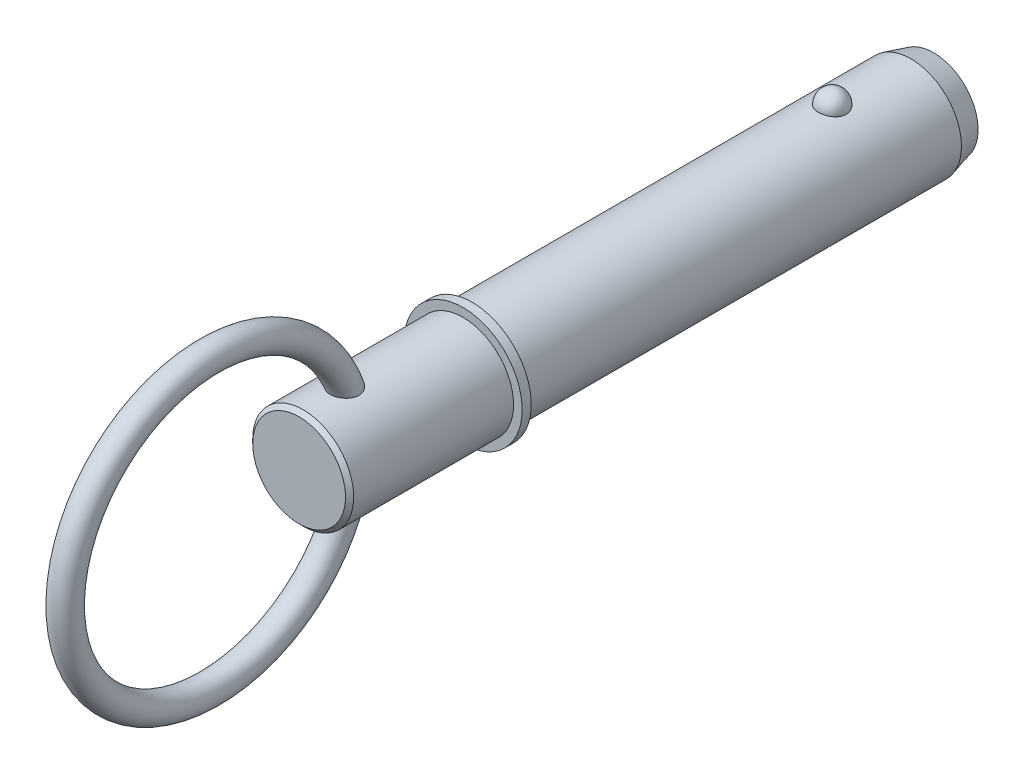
ISO-10303-21;
HEADER;
FILE_DESCRIPTION(('STEP AP214'),'2;1');
FILE_NAME('part.step','',(''),(''),'','','');
FILE_SCHEMA(('AUTOMOTIVE_DESIGN { 1 0 10303 214 1 1 1 1 }'));
ENDSEC;
DATA;
#1=APPLICATION_CONTEXT('core data for automotive mechanical design processes');
#2=APPLICATION_PROTOCOL_DEFINITION('international standard','automotive_design',2000,#1);
#3=PRODUCT_CONTEXT('',#1,'mechanical');
#4=PRODUCT('Part','Part','',(#3));
#5=PRODUCT_RELATED_PRODUCT_CATEGORY('part','',(#4));
#6=PRODUCT_DEFINITION_FORMATION('','',#4);
#7=PRODUCT_DEFINITION_CONTEXT('part definition',#1,'design');
#8=PRODUCT_DEFINITION('design','',#6,#7);
#9=PRODUCT_DEFINITION_SHAPE('','',#8);
#10=(LENGTH_UNIT() NAMED_UNIT(*) SI_UNIT(.MILLI.,.METRE.));
#11=(NAMED_UNIT(*) PLANE_ANGLE_UNIT() SI_UNIT($,.RADIAN.));
#12=(NAMED_UNIT(*) SI_UNIT($,.STERADIAN.) SOLID_ANGLE_UNIT());
#13=UNCERTAINTY_MEASURE_WITH_UNIT(LENGTH_MEASURE(1.E-05),#10,'distance_accuracy_value','');
#14=(GEOMETRIC_REPRESENTATION_CONTEXT(3) GLOBAL_UNCERTAINTY_ASSIGNED_CONTEXT((#13)) GLOBAL_UNIT_ASSIGNED_CONTEXT((#10,
#11,#12)) REPRESENTATION_CONTEXT('',''));
#15=CARTESIAN_POINT('',(0.,0.,0.));
#16=DIRECTION('',(0.,0.,1.));
#17=DIRECTION('',(1.,0.,0.));
#18=AXIS2_PLACEMENT_3D('',#15,#16,#17);
#19=CARTESIAN_POINT('',(0.,0.,76.2));
#20=DIRECTION('',(0.,0.,-1.));
#21=DIRECTION('',(-1.,0.,0.));
#22=AXIS2_PLACEMENT_3D('',#19,#20,#21);
#23=CYLINDRICAL_SURFACE('',#22,11.115);
#24=CARTESIAN_POINT('',(3.04058343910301,10.6910278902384,-3.07));
#25=CARTESIAN_POINT('',(3.04058039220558,10.6910304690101,-2.89837124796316));
#26=CARTESIAN_POINT('',(3.02657193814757,10.6950430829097,-2.72670368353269));
#27=CARTESIAN_POINT('',(2.97087341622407,10.7106465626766,-2.38822964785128));
#28=CARTESIAN_POINT('',(2.92917240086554,10.7222404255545,-2.22142512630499));
#29=CARTESIAN_POINT('',(2.81915317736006,10.751689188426,-1.89750816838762));
#30=CARTESIAN_POINT('',(2.75084669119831,10.7695413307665,-1.7403914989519));
#31=CARTESIAN_POINT('',(2.58932284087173,10.809510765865,-1.44013959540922));
#32=CARTESIAN_POINT('',(2.49610617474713,10.8316279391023,-1.29700396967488));
#33=CARTESIAN_POINT('',(2.28659317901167,10.877786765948,-1.02797591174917));
#34=CARTESIAN_POINT('',(2.17018825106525,10.9018371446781,-0.902169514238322));
#35=CARTESIAN_POINT('',(1.91759004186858,10.9490888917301,-0.672091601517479));
#36=CARTESIAN_POINT('',(1.78139672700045,10.9722902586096,-0.567820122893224));
#37=CARTESIAN_POINT('',(1.49327884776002,11.0151925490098,-0.383992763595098));
#38=CARTESIAN_POINT('',(1.34139928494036,11.034903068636,-0.304368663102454));
#39=CARTESIAN_POINT('',(1.02584823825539,11.0686948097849,-0.17173147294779));
#40=CARTESIAN_POINT('',(0.86217801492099,11.0827766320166,-0.118715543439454));
#41=CARTESIAN_POINT('',(0.530748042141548,11.1035404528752,-0.0415304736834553));
#42=CARTESIAN_POINT('',(0.363109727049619,11.1103474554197,-0.0168734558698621));
#43=CARTESIAN_POINT('',(0.025932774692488,11.1162480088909,0.00453486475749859));
#44=CARTESIAN_POINT('',(-0.143605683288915,11.1153422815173,0.00128877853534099));
#45=CARTESIAN_POINT('',(-0.477280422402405,11.1059854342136,-0.0327676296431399));
#46=CARTESIAN_POINT('',(-0.6414590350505,11.0976393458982,-0.0631942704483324));
#47=CARTESIAN_POINT('',(-0.962236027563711,11.0744390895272,-0.150220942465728));
#48=CARTESIAN_POINT('',(-1.11883427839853,11.0595848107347,-0.206821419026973));
#49=CARTESIAN_POINT('',(-1.42104610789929,11.0248420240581,-0.34502889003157));
#50=CARTESIAN_POINT('',(-1.56659244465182,11.0049254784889,-0.426775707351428));
#51=CARTESIAN_POINT('',(-1.8418931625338,10.9622119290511,-0.61295673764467));
#52=CARTESIAN_POINT('',(-1.97164597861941,10.9394146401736,-0.717393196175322));
#53=CARTESIAN_POINT('',(-2.21432263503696,10.8929139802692,-0.948332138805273));
#54=CARTESIAN_POINT('',(-2.32688909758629,10.8692016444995,-1.07520847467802));
#55=CARTESIAN_POINT('',(-2.52940007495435,10.8238699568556,-1.34622145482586));
#56=CARTESIAN_POINT('',(-2.6193430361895,10.8022507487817,-1.49035928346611));
#57=CARTESIAN_POINT('',(-2.77523958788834,10.7632629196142,-1.79367507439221));
#58=CARTESIAN_POINT('',(-2.8409151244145,10.7459442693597,-1.95300253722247));
#59=CARTESIAN_POINT('',(-2.94519180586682,10.7178360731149,-2.28083009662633));
#60=CARTESIAN_POINT('',(-2.98379371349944,10.707046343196,-2.44932993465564));
#61=CARTESIAN_POINT('',(-3.03284665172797,10.6932559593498,-2.78998091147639));
#62=CARTESIAN_POINT('',(-3.04341313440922,10.6902233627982,-2.96211412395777));
#63=CARTESIAN_POINT('',(-3.03646037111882,10.6922002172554,-3.305762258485));
#64=CARTESIAN_POINT('',(-3.0189418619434,10.6972094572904,-3.47727719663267));
#65=CARTESIAN_POINT('',(-2.95641582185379,10.7146564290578,-3.81396465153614));
#66=CARTESIAN_POINT('',(-2.91154117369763,10.7270582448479,-3.97916375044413));
#67=CARTESIAN_POINT('',(-2.79553341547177,10.7578713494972,-4.29947360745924));
#68=CARTESIAN_POINT('',(-2.72439927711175,10.7762828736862,-4.45458397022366));
#69=CARTESIAN_POINT('',(-2.55718900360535,10.8171819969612,-4.75123550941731));
#70=CARTESIAN_POINT('',(-2.46098224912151,10.8396907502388,-4.89270014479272));
#71=CARTESIAN_POINT('',(-2.24623042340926,10.8862165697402,-5.15724095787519));
#72=CARTESIAN_POINT('',(-2.12768452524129,10.9102336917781,-5.28031645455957));
#73=CARTESIAN_POINT('',(-1.87085107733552,10.9571990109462,-5.5050961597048));
#74=CARTESIAN_POINT('',(-1.73249451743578,10.9801430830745,-5.60672245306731));
#75=CARTESIAN_POINT('',(-1.44010079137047,11.0223008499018,-5.78517789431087));
#76=CARTESIAN_POINT('',(-1.28606470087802,11.0415148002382,-5.86200874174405));
#77=CARTESIAN_POINT('',(-0.968615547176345,11.0738491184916,-5.98788441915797));
#78=CARTESIAN_POINT('',(-0.805339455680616,11.0870408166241,-6.03725610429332));
#79=CARTESIAN_POINT('',(-0.472449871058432,11.1062048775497,-6.10820004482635));
#80=CARTESIAN_POINT('',(-0.302837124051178,11.11217808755,-6.1297755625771));
#81=CARTESIAN_POINT('',(0.0345765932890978,11.1162034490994,-6.1443619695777));
#82=CARTESIAN_POINT('',(0.20235372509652,11.1143988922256,-6.13788957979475));
#83=CARTESIAN_POINT('',(0.534364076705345,11.103390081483,-6.09773981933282));
#84=CARTESIAN_POINT('',(0.698597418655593,11.094186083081,-6.06406338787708));
#85=CARTESIAN_POINT('',(1.01830314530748,11.0694136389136,-5.97063285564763));
#86=CARTESIAN_POINT('',(1.17380497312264,11.0538682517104,-5.91097318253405));
#87=CARTESIAN_POINT('',(1.472484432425,11.0180608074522,-5.76723645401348));
#88=CARTESIAN_POINT('',(1.6156613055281,10.9977984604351,-5.68315789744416));
#89=CARTESIAN_POINT('',(1.88801614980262,10.9543574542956,-5.49138807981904));
#90=CARTESIAN_POINT('',(2.01695079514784,10.9311394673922,-5.38336024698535));
#91=CARTESIAN_POINT('',(2.25501495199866,10.8845248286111,-5.14733839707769));
#92=CARTESIAN_POINT('',(2.36414099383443,10.8611281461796,-5.01934088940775));
#93=CARTESIAN_POINT('',(2.56152595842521,10.8162958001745,-4.74447932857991));
#94=CARTESIAN_POINT('',(2.64940088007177,10.7948999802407,-4.59733288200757));
#95=CARTESIAN_POINT('',(2.79961494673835,10.7569242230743,-4.29001203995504));
#96=CARTESIAN_POINT('',(2.86196390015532,10.7403424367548,-4.12984267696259));
#97=CARTESIAN_POINT('',(2.95377333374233,10.715429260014,-3.820623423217));
#98=CARTESIAN_POINT('',(2.98627018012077,10.7063495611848,-3.67252681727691));
#99=CARTESIAN_POINT('',(3.02967634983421,10.6941478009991,-3.37296350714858));
#100=CARTESIAN_POINT('',(3.04058612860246,10.6910256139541,-3.2214968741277));
#101=CARTESIAN_POINT('',(3.04058343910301,10.6910278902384,-3.07));
#102=B_SPLINE_CURVE_WITH_KNOTS('',3,(#24,#25,#26,#27,#28,#29,#30,#31,#32,#33,#34,#35,#36,#37,
#38,#39,#40,#41,#42,#43,#44,#45,#46,#47,#48,#49,#50,#51,#52,#53,#54,#55,#56,#57,#58,#59,#60,#61,
#62,#63,#64,#65,#66,#67,#68,#69,#70,#71,#72,#73,#74,#75,#76,#77,#78,#79,#80,#81,#82,#83,#84,#85,
#86,#87,#88,#89,#90,#91,#92,#93,#94,#95,#96,#97,#98,#99,#100,#101),.UNSPECIFIED.,.T.,.F.,(4,2,2,
2,2,2,2,2,2,2,2,2,2,2,2,2,2,2,2,2,2,2,2,2,2,2,2,2,2,2,2,2,2,2,2,2,2,2,4),(0.,0.514341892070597,
1.02888723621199,1.54320613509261,2.0575106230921,2.57428293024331,3.09105611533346,
3.60638589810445,4.1216606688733,4.62793159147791,5.13415514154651,5.63334381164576,
6.13254097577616,6.63456562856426,7.13663998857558,7.64804063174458,8.15947638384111,
8.67660265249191,9.19371435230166,9.70869321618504,10.223658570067,10.7361421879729,
11.2486458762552,11.7638748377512,12.2791228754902,12.7962115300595,13.3132647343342,
13.8240238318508,14.3347229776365,14.8360540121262,15.3373677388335,15.8368746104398,
16.3364121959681,16.8434736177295,17.3506237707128,17.8663484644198,18.3818748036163,
18.8358944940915,19.2899046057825),.UNSPECIFIED.);
#103=CARTESIAN_POINT('',(3.04058343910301,10.6910278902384,-3.07));
#104=VERTEX_POINT('',#103);
#105=EDGE_CURVE('E101',#104,#104,#102,.T.);
#106=ORIENTED_EDGE('',*,*,#105,.T.);
#107=EDGE_LOOP('',(#106));
#108=FACE_BOUND('',#107,.T.);
#109=CARTESIAN_POINT('',(0.,0.,-20.4));
#110=DIRECTION('',(0.,0.,-1.));
#111=DIRECTION('',(-1.,0.,0.));
#112=AXIS2_PLACEMENT_3D('',#109,#110,#111);
#113=CIRCLE('',#112,11.115);
#114=CARTESIAN_POINT('',(-11.115,0.,-20.4));
#115=VERTEX_POINT('',#114);
#116=EDGE_CURVE('E109',#115,#115,#113,.F.);
#117=ORIENTED_EDGE('',*,*,#116,.T.);
#118=EDGE_LOOP('',(#117));
#119=FACE_BOUND('',#118,.T.);
#120=CARTESIAN_POINT('',(0.,0.,76.2));
#121=DIRECTION('',(0.,0.,1.));
#122=DIRECTION('',(1.,0.,0.));
#123=AXIS2_PLACEMENT_3D('',#120,#121,#122);
#124=CIRCLE('',#123,11.115);
#125=CARTESIAN_POINT('',(11.115,0.,76.2));
#126=VERTEX_POINT('',#125);
#127=EDGE_CURVE('E107',#126,#126,#124,.T.);
#128=ORIENTED_EDGE('',*,*,#127,.F.);
#129=EDGE_LOOP('',(#128));
#130=FACE_BOUND('',#129,.T.);
#131=ADVANCED_FACE('F39',(#108,#119,#130),#23,.T.);
#132=CARTESIAN_POINT('',(0.,0.,-25.4));
#133=DIRECTION('',(0.,0.,-1.));
#134=DIRECTION('',(-1.,0.,0.));
#135=AXIS2_PLACEMENT_3D('',#132,#133,#134);
#136=PLANE('',#135);
#137=CARTESIAN_POINT('',(0.,0.,-25.4));
#138=DIRECTION('',(0.,0.,-1.));
#139=DIRECTION('',(-1.,0.,0.));
#140=AXIS2_PLACEMENT_3D('',#137,#138,#139);
#141=CIRCLE('',#140,9.77525403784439);
#142=CARTESIAN_POINT('',(-9.77525403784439,0.,-25.4));
#143=VERTEX_POINT('',#142);
#144=EDGE_CURVE('E142',#143,#143,#141,.T.);
#145=ORIENTED_EDGE('',*,*,#144,.T.);
#146=EDGE_LOOP('',(#145));
#147=FACE_BOUND('',#146,.T.);
#148=ADVANCED_FACE('F87',(#147),#136,.T.);
#149=CARTESIAN_POINT('',(0.,0.,-25.4));
#150=DIRECTION('',(0.,0.,1.));
#151=DIRECTION('',(1.,0.,0.));
#152=AXIS2_PLACEMENT_3D('',#149,#150,#151);
#153=CONICAL_SURFACE('',#152,9.7752540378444,0.26179938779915);
#154=ORIENTED_EDGE('',*,*,#116,.F.);
#155=EDGE_LOOP('',(#154));
#156=FACE_BOUND('',#155,.T.);
#157=ORIENTED_EDGE('',*,*,#144,.F.);
#158=EDGE_LOOP('',(#157));
#159=FACE_BOUND('',#158,.T.);
#160=ADVANCED_FACE('F93',(#156,#159),#153,.T.);
#161=CARTESIAN_POINT('',(0.,11.115,-3.07));
#162=DIRECTION('',(0.,1.,0.));
#163=DIRECTION('',(0.,0.,1.));
#164=AXIS2_PLACEMENT_3D('',#161,#162,#163);
#165=SPHERICAL_SURFACE('',#164,3.07);
#166=ORIENTED_EDGE('',*,*,#105,.F.);
#167=EDGE_LOOP('',(#166));
#168=FACE_BOUND('',#167,.T.);
#169=ADVANCED_FACE('F112',(#168),#165,.T.);
#170=CARTESIAN_POINT('',(0.,0.,76.2));
#171=DIRECTION('',(0.,0.,-1.));
#172=DIRECTION('',(-1.,0.,0.));
#173=AXIS2_PLACEMENT_3D('',#170,#171,#172);
#174=PLANE('',#173);
#175=ORIENTED_EDGE('',*,*,#127,.T.);
#176=EDGE_LOOP('',(#175));
#177=FACE_BOUND('',#176,.T.);
#178=CARTESIAN_POINT('',(0.,0.,76.2));
#179=DIRECTION('',(0.,0.,-1.));
#180=DIRECTION('',(-1.,0.,0.));
#181=AXIS2_PLACEMENT_3D('',#178,#179,#180);
#182=CIRCLE('',#181,13.);
#183=CARTESIAN_POINT('',(-13.,0.,76.2));
#184=VERTEX_POINT('',#183);
#185=EDGE_CURVE('E108',#184,#184,#182,.T.);
#186=ORIENTED_EDGE('',*,*,#185,.T.);
#187=EDGE_LOOP('',(#186));
#188=FACE_BOUND('',#187,.T.);
#189=ADVANCED_FACE('F116',(#177,#188),#174,.T.);
#190=CARTESIAN_POINT('',(0.,0.,33.7287874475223));
#191=DIRECTION('',(0.,0.,-1.));
#192=DIRECTION('',(-1.,0.,0.));
#193=AXIS2_PLACEMENT_3D('',#190,#191,#192);
#194=CYLINDRICAL_SURFACE('',#193,13.);
#195=CARTESIAN_POINT('',(0.,0.,78.2));
#196=DIRECTION('',(0.,0.,-1.));
#197=DIRECTION('',(-1.,0.,0.));
#198=AXIS2_PLACEMENT_3D('',#195,#196,#197);
#199=CIRCLE('',#198,13.);
#200=CARTESIAN_POINT('',(-13.,0.,78.2));
#201=VERTEX_POINT('',#200);
#202=EDGE_CURVE('E133',#201,#201,#199,.T.);
#203=ORIENTED_EDGE('',*,*,#202,.T.);
#204=EDGE_LOOP('',(#203));
#205=FACE_BOUND('',#204,.T.);
#206=ORIENTED_EDGE('',*,*,#185,.F.);
#207=EDGE_LOOP('',(#206));
#208=FACE_BOUND('',#207,.T.);
#209=ADVANCED_FACE('F120',(#205,#208),#194,.T.);
#210=CARTESIAN_POINT('',(0.,13.,78.2));
#211=DIRECTION('',(0.,0.,1.));
#212=DIRECTION('',(1.,0.,0.));
#213=AXIS2_PLACEMENT_3D('',#210,#211,#212);
#214=PLANE('',#213);
#215=CARTESIAN_POINT('',(0.,0.,78.2));
#216=DIRECTION('',(0.,0.,1.));
#217=DIRECTION('',(1.,0.,0.));
#218=AXIS2_PLACEMENT_3D('',#215,#216,#217);
#219=CIRCLE('',#218,11.115);
#220=CARTESIAN_POINT('',(11.115,0.,78.2));
#221=VERTEX_POINT('',#220);
#222=EDGE_CURVE('E111',#221,#221,#219,.T.);
#223=ORIENTED_EDGE('',*,*,#222,.F.);
#224=EDGE_LOOP('',(#223));
#225=FACE_BOUND('',#224,.T.);
#226=ORIENTED_EDGE('',*,*,#202,.F.);
#227=EDGE_LOOP('',(#226));
#228=FACE_BOUND('',#227,.T.);
#229=ADVANCED_FACE('F84',(#225,#228),#214,.T.);
#230=CARTESIAN_POINT('',(0.,0.,114.3));
#231=DIRECTION('',(0.,0.,-1.));
#232=DIRECTION('',(-1.,0.,0.));
#233=AXIS2_PLACEMENT_3D('',#230,#231,#232);
#234=CYLINDRICAL_SURFACE('',#233,11.115);
#235=CARTESIAN_POINT('',(-1.22435852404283,-11.0473603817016,101.378419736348));
#236=CARTESIAN_POINT('',(-1.07078016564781,-11.0643805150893,101.311699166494));
#237=CARTESIAN_POINT('',(-0.911372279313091,-11.0787777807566,101.257745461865));
#238=CARTESIAN_POINT('',(-0.585451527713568,-11.1007717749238,101.176552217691));
#239=CARTESIAN_POINT('',(-0.418938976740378,-11.1083688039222,101.149311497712));
#240=CARTESIAN_POINT('',(-0.0835394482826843,-11.1159515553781,101.122121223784));
#241=CARTESIAN_POINT('',(0.0853474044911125,-11.1159376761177,101.122170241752));
#242=CARTESIAN_POINT('',(0.420723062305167,-11.1083011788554,101.149554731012));
#243=CARTESIAN_POINT('',(0.587211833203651,-11.1006784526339,101.176890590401));
#244=CARTESIAN_POINT('',(0.913189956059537,-11.0786293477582,101.25829957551));
#245=CARTESIAN_POINT('',(1.07267378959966,-11.0641977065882,101.312393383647));
#246=CARTESIAN_POINT('',(1.3799404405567,-11.0300907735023,101.446140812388));
#247=CARTESIAN_POINT('',(1.52772335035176,-11.0104155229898,101.525794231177));
#248=CARTESIAN_POINT('',(1.80679367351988,-10.9680716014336,101.708467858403));
#249=CARTESIAN_POINT('',(1.93814041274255,-10.945414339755,101.811400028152));
#250=CARTESIAN_POINT('',(2.18117403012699,-10.8995884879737,102.038212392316));
#251=CARTESIAN_POINT('',(2.29286356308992,-10.8764199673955,102.162089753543));
#252=CARTESIAN_POINT('',(2.49238969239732,-10.8324319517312,102.425992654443));
#253=CARTESIAN_POINT('',(2.58046870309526,-10.8115899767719,102.565831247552));
#254=CARTESIAN_POINT('',(2.73218762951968,-10.7742522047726,102.858691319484));
#255=CARTESIAN_POINT('',(2.7958294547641,-10.757756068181,103.011711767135));
#256=CARTESIAN_POINT('',(2.89767977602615,-10.7307723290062,103.3266092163));
#257=CARTESIAN_POINT('',(2.93586554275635,-10.7202900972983,103.488493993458));
#258=CARTESIAN_POINT('',(2.98678800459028,-10.7062139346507,103.816480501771));
#259=CARTESIAN_POINT('',(2.99951894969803,-10.7026215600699,103.982583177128));
#260=CARTESIAN_POINT('',(3.0004780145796,-10.7023530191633,104.323227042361));
#261=CARTESIAN_POINT('',(2.98743421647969,-10.7060358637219,104.497770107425));
#262=CARTESIAN_POINT('',(2.93592917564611,-10.7202719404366,104.842750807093));
#263=CARTESIAN_POINT('',(2.89745825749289,-10.7308277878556,105.013186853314));
#264=CARTESIAN_POINT('',(2.79180512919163,-10.7588257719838,105.363114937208));
#265=CARTESIAN_POINT('',(2.72213928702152,-10.776850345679,105.541811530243));
#266=CARTESIAN_POINT('',(2.55612841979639,-10.8174264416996,105.885974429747));
#267=CARTESIAN_POINT('',(2.45975697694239,-10.8399824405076,106.051427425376));
#268=CARTESIAN_POINT('',(2.23434632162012,-10.8887625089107,106.375672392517));
#269=CARTESIAN_POINT('',(2.10349593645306,-10.9151327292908,106.533192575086));
#270=CARTESIAN_POINT('',(1.81505097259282,-10.96677510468,106.821668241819));
#271=CARTESIAN_POINT('',(1.65749731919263,-10.9920488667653,106.95266371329));
#272=CARTESIAN_POINT('',(1.36197799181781,-11.0319737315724,107.151313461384));
#273=CARTESIAN_POINT('',(1.22927684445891,-11.0476896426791,107.22660092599));
#274=CARTESIAN_POINT('',(0.952979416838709,-11.0749380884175,107.354574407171));
#275=CARTESIAN_POINT('',(0.809393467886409,-11.0864745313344,107.407281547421));
#276=CARTESIAN_POINT('',(0.513954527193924,-11.1041011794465,107.487058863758));
#277=CARTESIAN_POINT('',(0.362058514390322,-11.1101594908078,107.513978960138));
#278=CARTESIAN_POINT('',(0.05577929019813,-11.1159132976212,107.539559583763));
#279=CARTESIAN_POINT('',(-0.0986030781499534,-11.1156109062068,107.538229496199));
#280=CARTESIAN_POINT('',(-0.389768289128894,-11.1090283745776,107.508935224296));
#281=CARTESIAN_POINT('',(-0.526830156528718,-11.1033186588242,107.483512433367));
#282=CARTESIAN_POINT('',(-0.79487824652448,-11.0873547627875,107.411270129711));
#283=CARTESIAN_POINT('',(-0.925863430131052,-11.0770998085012,107.364446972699));
#284=CARTESIAN_POINT('',(-1.18354406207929,-11.0525934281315,107.249843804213));
#285=CARTESIAN_POINT('',(-1.30991621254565,-11.0382116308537,107.181371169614));
#286=CARTESIAN_POINT('',(-1.55122352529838,-11.0068962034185,107.027131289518));
#287=CARTESIAN_POINT('',(-1.66615377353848,-10.9899614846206,106.941356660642));
#288=CARTESIAN_POINT('',(-1.90024050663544,-10.9520991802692,106.74087205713));
#289=CARTESIAN_POINT('',(-2.01728342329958,-10.9309598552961,106.623737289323));
#290=CARTESIAN_POINT('',(-2.23333659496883,-10.8888735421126,106.373839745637));
#291=CARTESIAN_POINT('',(-2.33233396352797,-10.8679267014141,106.241065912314));
#292=CARTESIAN_POINT('',(-2.52607041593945,-10.8246766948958,105.940000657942));
#293=CARTESIAN_POINT('',(-2.6174157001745,-10.8027194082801,105.769462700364));
#294=CARTESIAN_POINT('',(-2.77251687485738,-10.7639568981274,105.415671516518));
#295=CARTESIAN_POINT('',(-2.8362578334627,-10.7471544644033,105.232411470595));
#296=CARTESIAN_POINT('',(-2.93668505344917,-10.7201706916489,104.846624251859));
#297=CARTESIAN_POINT('',(-2.97161961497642,-10.7104219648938,104.643594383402));
#298=CARTESIAN_POINT('',(-2.99683495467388,-10.7033740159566,104.336874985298));
#299=CARTESIAN_POINT('',(-3.00070536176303,-10.7022882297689,104.234234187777));
#300=CARTESIAN_POINT('',(-2.99908594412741,-10.7027439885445,104.029049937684));
#301=CARTESIAN_POINT('',(-2.99360154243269,-10.7042840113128,103.926506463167));
#302=CARTESIAN_POINT('',(-2.97382504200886,-10.7097936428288,103.730330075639));
#303=CARTESIAN_POINT('',(-2.9602439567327,-10.7135669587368,103.636619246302));
#304=CARTESIAN_POINT('',(-2.92480741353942,-10.723295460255,103.450932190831));
#305=CARTESIAN_POINT('',(-2.90295619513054,-10.7292495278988,103.35895510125));
#306=CARTESIAN_POINT('',(-2.8509700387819,-10.7431800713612,103.177547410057));
#307=CARTESIAN_POINT('',(-2.82083748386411,-10.7511559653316,103.088116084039));
#308=CARTESIAN_POINT('',(-2.75241691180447,-10.7688750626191,102.91264532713));
#309=CARTESIAN_POINT('',(-2.71412954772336,-10.7786181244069,102.82660562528));
#310=CARTESIAN_POINT('',(-2.59550576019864,-10.807996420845,102.591055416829));
#311=CARTESIAN_POINT('',(-2.50612224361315,-10.8292837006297,102.446173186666));
#312=CARTESIAN_POINT('',(-2.30366035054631,-10.8741467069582,102.174571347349));
#313=CARTESIAN_POINT('',(-2.19058370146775,-10.8977222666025,102.047850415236));
#314=CARTESIAN_POINT('',(-1.94442412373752,-10.9443154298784,101.816462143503));
#315=CARTESIAN_POINT('',(-1.81141354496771,-10.967334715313,101.71171820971));
#316=CARTESIAN_POINT('',(-1.529042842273,-11.0102504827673,101.526435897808));
#317=CARTESIAN_POINT('',(-1.3796820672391,-11.0301468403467,101.445898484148));
#318=CARTESIAN_POINT('',(-1.22435852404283,-11.0473603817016,101.378419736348));
#319=B_SPLINE_CURVE_WITH_KNOTS('',3,(#235,#236,#237,#238,#239,#240,#241,#242,#243,#244,#245,
#246,#247,#248,#249,#250,#251,#252,#253,#254,#255,#256,#257,#258,#259,#260,#261,#262,#263,#264,
#265,#266,#267,#268,#269,#270,#271,#272,#273,#274,#275,#276,#277,#278,#279,#280,#281,#282,#283,
#284,#285,#286,#287,#288,#289,#290,#291,#292,#293,#294,#295,#296,#297,#298,#299,#300,#301,#302,
#303,#304,#305,#306,#307,#308,#309,#310,#311,#312,#313,#314,#315,#316,#317,#318),.UNSPECIFIED.,
.T.,.F.,(4,2,2,2,2,2,2,2,2,2,2,2,2,2,2,2,2,2,2,2,2,2,2,2,2,2,2,2,2,2,2,2,2,2,2,2,2,2,2,2,2,4),
(0.,0.504317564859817,1.00861284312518,1.51288173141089,2.01715779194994,2.52182424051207,
3.02648670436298,3.52927157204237,4.03198848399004,4.52932690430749,5.02662645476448,
5.52436944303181,6.02222485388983,6.54526169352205,7.06849767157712,7.64398785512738,
8.22004937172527,8.83633461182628,9.45168373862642,9.90997173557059,10.3678300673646,
10.8283372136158,11.2886913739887,11.7053264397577,12.1220324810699,12.5537129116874,
12.9855779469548,13.4844842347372,13.9837454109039,14.5653303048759,15.1472294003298,
15.762338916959,16.0701226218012,16.3777279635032,16.6616380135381,16.9454027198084,
17.229085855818,17.5127462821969,18.0246262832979,18.5364689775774,19.0464970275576,
19.5565453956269),.UNSPECIFIED.);
#320=CARTESIAN_POINT('',(-1.22435852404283,-11.0473603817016,101.378419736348));
#321=VERTEX_POINT('',#320);
#322=EDGE_CURVE('E10',#321,#321,#319,.T.);
#323=ORIENTED_EDGE('',*,*,#322,.F.);
#324=EDGE_LOOP('',(#323));
#325=FACE_BOUND('',#324,.T.);
#326=CARTESIAN_POINT('',(-1.22435852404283,11.0473603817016,101.378419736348));
#327=CARTESIAN_POINT('',(-1.37630771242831,11.0305212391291,101.444431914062));
#328=CARTESIAN_POINT('',(-1.52254325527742,11.0111158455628,101.522938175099));
#329=CARTESIAN_POINT('',(-1.79945383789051,10.9692671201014,101.70315338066));
#330=CARTESIAN_POINT('',(-1.93013010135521,10.9468240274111,101.804860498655));
#331=CARTESIAN_POINT('',(-2.17227655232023,10.9013603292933,102.029035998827));
#332=CARTESIAN_POINT('',(-2.28373752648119,10.8783394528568,102.151514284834));
#333=CARTESIAN_POINT('',(-2.4842745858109,10.8343057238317,102.413895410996));
#334=CARTESIAN_POINT('',(-2.57335330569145,10.8132926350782,102.553796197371));
#335=CARTESIAN_POINT('',(-2.7264007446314,10.7757209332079,102.845964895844));
#336=CARTESIAN_POINT('',(-2.79054231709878,10.7591319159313,102.99813851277));
#337=CARTESIAN_POINT('',(-2.89354234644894,10.7318913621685,103.311286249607));
#338=CARTESIAN_POINT('',(-2.93239912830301,10.7212402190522,103.472260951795));
#339=CARTESIAN_POINT('',(-2.98540436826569,10.7066038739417,103.801955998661));
#340=CARTESIAN_POINT('',(-2.9990165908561,10.7027634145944,103.970768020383));
#341=CARTESIAN_POINT('',(-3.00088147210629,10.7022388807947,104.308508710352));
#342=CARTESIAN_POINT('',(-2.98912652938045,10.7055569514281,104.477437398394));
#343=CARTESIAN_POINT('',(-2.93985175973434,10.7191979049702,104.824856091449));
#344=CARTESIAN_POINT('',(-2.90036626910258,10.7300544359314,105.003044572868));
#345=CARTESIAN_POINT('',(-2.79555002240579,10.7578360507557,105.351215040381));
#346=CARTESIAN_POINT('',(-2.73019988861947,10.774765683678,105.521190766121));
#347=CARTESIAN_POINT('',(-2.56762574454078,10.8147227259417,105.865784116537));
#348=CARTESIAN_POINT('',(-2.46786230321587,10.838191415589,106.039157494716));
#349=CARTESIAN_POINT('',(-2.24100420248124,10.8873575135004,106.366686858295));
#350=CARTESIAN_POINT('',(-2.11391925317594,10.9130541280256,106.520849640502));
#351=CARTESIAN_POINT('',(-1.85542700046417,10.9597063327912,106.782735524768));
#352=CARTESIAN_POINT('',(-1.72758345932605,10.9807909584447,106.893955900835));
#353=CARTESIAN_POINT('',(-1.45489931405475,11.0202250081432,107.09412236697));
#354=CARTESIAN_POINT('',(-1.31006770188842,11.0385758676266,107.183080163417));
#355=CARTESIAN_POINT('',(-1.0817116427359,11.0625084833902,107.2963702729));
#356=CARTESIAN_POINT('',(-1.00332234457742,11.069914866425,107.330896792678));
#357=CARTESIAN_POINT('',(-0.843525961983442,11.0832350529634,107.392391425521));
#358=CARTESIAN_POINT('',(-0.762120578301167,11.0891496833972,107.419363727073));
#359=CARTESIAN_POINT('',(-0.59701447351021,11.0992628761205,107.46518193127));
#360=CARTESIAN_POINT('',(-0.513315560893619,11.1034627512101,107.484034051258));
#361=CARTESIAN_POINT('',(-0.34437442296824,11.1099851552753,107.513209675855));
#362=CARTESIAN_POINT('',(-0.259132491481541,11.1123080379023,107.523534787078));
#363=CARTESIAN_POINT('',(-0.10083895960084,11.114780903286,107.534519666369));
#364=CARTESIAN_POINT('',(-0.0278735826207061,11.1152042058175,107.536395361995));
#365=CARTESIAN_POINT('',(0.117962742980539,11.1146132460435,107.533773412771));
#366=CARTESIAN_POINT('',(0.190833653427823,11.1135985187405,107.529273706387));
#367=CARTESIAN_POINT('',(0.335842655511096,11.110161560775,107.513978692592));
#368=CARTESIAN_POINT('',(0.40798108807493,11.1077400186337,107.503186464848));
#369=CARTESIAN_POINT('',(0.551029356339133,11.1015643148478,107.475503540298));
#370=CARTESIAN_POINT('',(0.621938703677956,11.0978096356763,107.458610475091));
#371=CARTESIAN_POINT('',(0.825381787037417,11.0851145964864,107.401054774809));
#372=CARTESIAN_POINT('',(0.955713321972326,11.0745538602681,107.352705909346));
#373=CARTESIAN_POINT('',(1.20733127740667,11.0499605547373,107.237325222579));
#374=CARTESIAN_POINT('',(1.32861527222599,11.0359270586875,107.170288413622));
#375=CARTESIAN_POINT('',(1.5734436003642,11.0038352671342,107.011843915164));
#376=CARTESIAN_POINT('',(1.69572941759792,10.9855025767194,106.918551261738));
#377=CARTESIAN_POINT('',(1.9256521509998,10.9475431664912,106.715650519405));
#378=CARTESIAN_POINT('',(2.03328016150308,10.9279156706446,106.606032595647));
#379=CARTESIAN_POINT('',(2.25048911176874,10.8854412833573,106.35299112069));
#380=CARTESIAN_POINT('',(2.35710396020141,10.8626332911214,106.207010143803));
#381=CARTESIAN_POINT('',(2.54757318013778,10.8195493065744,105.900478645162));
#382=CARTESIAN_POINT('',(2.63141052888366,10.799275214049,105.739917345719));
#383=CARTESIAN_POINT('',(2.78342312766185,10.7611645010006,105.387827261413));
#384=CARTESIAN_POINT('',(2.84851472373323,10.7439117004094,105.194893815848));
#385=CARTESIAN_POINT('',(2.94562652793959,10.7177011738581,104.800130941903));
#386=CARTESIAN_POINT('',(2.97764942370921,10.7087427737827,104.59830223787));
#387=CARTESIAN_POINT('',(2.99864828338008,10.7028651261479,104.295989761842));
#388=CARTESIAN_POINT('',(3.00125529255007,10.7021342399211,104.196378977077));
#389=CARTESIAN_POINT('',(2.9976304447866,10.7031517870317,103.997345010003));
#390=CARTESIAN_POINT('',(2.99140295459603,10.704898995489,103.897921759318));
#391=CARTESIAN_POINT('',(2.96990080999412,10.710883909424,103.700179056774));
#392=CARTESIAN_POINT('',(2.95463019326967,10.7151205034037,103.601859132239));
#393=CARTESIAN_POINT('',(2.91493260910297,10.7259879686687,103.407219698));
#394=CARTESIAN_POINT('',(2.89050674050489,10.7326185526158,103.310899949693));
#395=CARTESIAN_POINT('',(2.83556656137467,10.7472556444,103.131222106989));
#396=CARTESIAN_POINT('',(2.80596337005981,10.7550439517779,103.047566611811));
#397=CARTESIAN_POINT('',(2.73953102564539,10.7721572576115,102.883300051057));
#398=CARTESIAN_POINT('',(2.70269935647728,10.7814827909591,102.802690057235));
#399=CARTESIAN_POINT('',(2.62203440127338,10.801383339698,102.645273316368));
#400=CARTESIAN_POINT('',(2.57820565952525,10.8119575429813,102.568464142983));
#401=CARTESIAN_POINT('',(2.48382482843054,10.8340293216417,102.419223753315));
#402=CARTESIAN_POINT('',(2.43327032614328,10.8455272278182,102.346794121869));
#403=CARTESIAN_POINT('',(2.27895739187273,10.879345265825,102.145992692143));
#404=CARTESIAN_POINT('',(2.16717186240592,10.9023791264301,102.023764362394));
#405=CARTESIAN_POINT('',(1.92442677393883,10.9478318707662,101.800151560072));
#406=CARTESIAN_POINT('',(1.79346836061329,10.9702507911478,101.698765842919));
#407=CARTESIAN_POINT('',(1.51657151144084,11.0119360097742,101.519564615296));
#408=CARTESIAN_POINT('',(1.37069187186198,11.0312139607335,101.441661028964));
#409=CARTESIAN_POINT('',(1.06764402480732,11.0646548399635,101.310680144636));
#410=CARTESIAN_POINT('',(0.910475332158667,11.0788175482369,101.257603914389));
#411=CARTESIAN_POINT('',(0.587492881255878,11.1006548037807,101.17697871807));
#412=CARTESIAN_POINT('',(0.421604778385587,11.1082585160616,101.149708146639));
#413=CARTESIAN_POINT('',(0.0874262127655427,11.1159127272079,101.122259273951));
#414=CARTESIAN_POINT('',(-0.0808643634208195,11.1159628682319,101.12208225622));
#415=CARTESIAN_POINT('',(-0.416252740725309,11.1084780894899,101.148918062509));
#416=CARTESIAN_POINT('',(-0.583334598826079,11.1008914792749,101.176116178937));
#417=CARTESIAN_POINT('',(-0.910355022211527,11.0788693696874,101.257401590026));
#418=CARTESIAN_POINT('',(-1.07029370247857,11.064433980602,101.311488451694));
#419=CARTESIAN_POINT('',(-1.22435852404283,11.0473603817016,101.378419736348));
#420=B_SPLINE_CURVE_WITH_KNOTS('',3,(#326,#327,#328,#329,#330,#331,#332,#333,#334,#335,#336,
#337,#338,#339,#340,#341,#342,#343,#344,#345,#346,#347,#348,#349,#350,#351,#352,#353,#354,#355,
#356,#357,#358,#359,#360,#361,#362,#363,#364,#365,#366,#367,#368,#369,#370,#371,#372,#373,#374,
#375,#376,#377,#378,#379,#380,#381,#382,#383,#384,#385,#386,#387,#388,#389,#390,#391,#392,#393,
#394,#395,#396,#397,#398,#399,#400,#401,#402,#403,#404,#405,#406,#407,#408,#409,#410,#411,#412,
#413,#414,#415,#416,#417,#418,#419),.UNSPECIFIED.,.T.,.F.,(4,2,2,2,2,2,2,2,2,2,2,2,2,2,2,2,2,2,
2,2,2,2,2,2,2,2,2,2,2,2,2,2,2,2,2,2,2,2,2,2,2,2,2,2,2,2,4),(0.,0.498977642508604,
0.99791601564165,1.49709295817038,1.99621111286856,2.49180514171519,2.98743199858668,
3.49347125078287,3.99966216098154,4.54591839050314,5.09258465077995,5.69407889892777,
6.29535972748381,6.80565832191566,7.31568801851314,7.57328514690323,7.83073916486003,
8.08799570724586,8.34520376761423,8.56389164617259,8.78265025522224,9.00130188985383,
9.22003849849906,9.63638938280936,10.0528514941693,10.5157946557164,10.9790178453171,
11.5234572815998,12.0683024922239,12.6784825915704,13.288613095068,13.5872082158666,
13.8856557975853,14.1839702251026,14.482248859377,14.7491407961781,15.016125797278,
15.2829381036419,15.5498463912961,16.0489312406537,16.5479862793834,17.0451454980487,
17.542326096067,18.0448111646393,18.5473200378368,19.0532532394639,19.5591782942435),.UNSPECIFIED.);
#421=CARTESIAN_POINT('',(-1.22435852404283,11.0473603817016,101.378419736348));
#422=VERTEX_POINT('',#421);
#423=EDGE_CURVE('E51',#422,#422,#420,.T.);
#424=ORIENTED_EDGE('',*,*,#423,.F.);
#425=EDGE_LOOP('',(#424));
#426=FACE_BOUND('',#425,.T.);
#427=CARTESIAN_POINT('',(0.,0.,113.4));
#428=DIRECTION('',(0.,0.,-1.));
#429=DIRECTION('',(-1.,0.,0.));
#430=AXIS2_PLACEMENT_3D('',#427,#428,#429);
#431=CIRCLE('',#430,11.115);
#432=CARTESIAN_POINT('',(-11.115,0.,113.4));
#433=VERTEX_POINT('',#432);
#434=EDGE_CURVE('E63',#433,#433,#431,.T.);
#435=ORIENTED_EDGE('',*,*,#434,.T.);
#436=EDGE_LOOP('',(#435));
#437=FACE_BOUND('',#436,.T.);
#438=ORIENTED_EDGE('',*,*,#222,.T.);
#439=EDGE_LOOP('',(#438));
#440=FACE_BOUND('',#439,.T.);
#441=ADVANCED_FACE('F68',(#325,#426,#437,#440),#234,.T.);
#442=CARTESIAN_POINT('',(0.,0.,114.3));
#443=DIRECTION('',(0.,0.,-1.));
#444=DIRECTION('',(-1.,0.,0.));
#445=AXIS2_PLACEMENT_3D('',#442,#443,#444);
#446=PLANE('',#445);
#447=CARTESIAN_POINT('',(0.,0.,114.3));
#448=DIRECTION('',(0.,0.,-1.));
#449=DIRECTION('',(-1.,0.,0.));
#450=AXIS2_PLACEMENT_3D('',#447,#448,#449);
#451=CIRCLE('',#450,10.2149999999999);
#452=CARTESIAN_POINT('',(-10.2149999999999,0.,114.3));
#453=VERTEX_POINT('',#452);
#454=EDGE_CURVE('E58',#453,#453,#451,.F.);
#455=ORIENTED_EDGE('',*,*,#454,.T.);
#456=EDGE_LOOP('',(#455));
#457=FACE_BOUND('',#456,.T.);
#458=ADVANCED_FACE('F75',(#457),#446,.F.);
#459=CARTESIAN_POINT('',(0.,0.,113.4));
#460=DIRECTION('',(0.,0.,-1.));
#461=DIRECTION('',(-1.,0.,0.));
#462=AXIS2_PLACEMENT_3D('',#459,#460,#461);
#463=CONICAL_SURFACE('',#462,11.115,0.785398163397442);
#464=ORIENTED_EDGE('',*,*,#454,.F.);
#465=EDGE_LOOP('',(#464));
#466=FACE_BOUND('',#465,.T.);
#467=ORIENTED_EDGE('',*,*,#434,.F.);
#468=EDGE_LOOP('',(#467));
#469=FACE_BOUND('',#468,.T.);
#470=ADVANCED_FACE('F41',(#466,#469),#463,.T.);
#471=CARTESIAN_POINT('',(0.,0.,134.05));
#472=DIRECTION('',(1.,0.,0.));
#473=DIRECTION('',(0.,0.,-1.));
#474=AXIS2_PLACEMENT_3D('',#471,#472,#473);
#475=TOROIDAL_SURFACE('',#474,31.75,3.);
#476=ORIENTED_EDGE('',*,*,#322,.T.);
#477=EDGE_LOOP('',(#476));
#478=FACE_BOUND('',#477,.T.);
#479=ORIENTED_EDGE('',*,*,#423,.T.);
#480=EDGE_LOOP('',(#479));
#481=FACE_BOUND('',#480,.T.);
#482=ADVANCED_FACE('F72',(#478,#481),#475,.T.);
#483=CLOSED_SHELL('',(#131,#148,#160,#169,#189,#209,#229,#441,#458,#470,#482));
#484=MANIFOLD_SOLID_BREP('B2',#483);
#485=ADVANCED_BREP_SHAPE_REPRESENTATION('',(#18,#484),#14);
#486=SHAPE_DEFINITION_REPRESENTATION(#9,#485);
ENDSEC;
END-ISO-10303-21;
